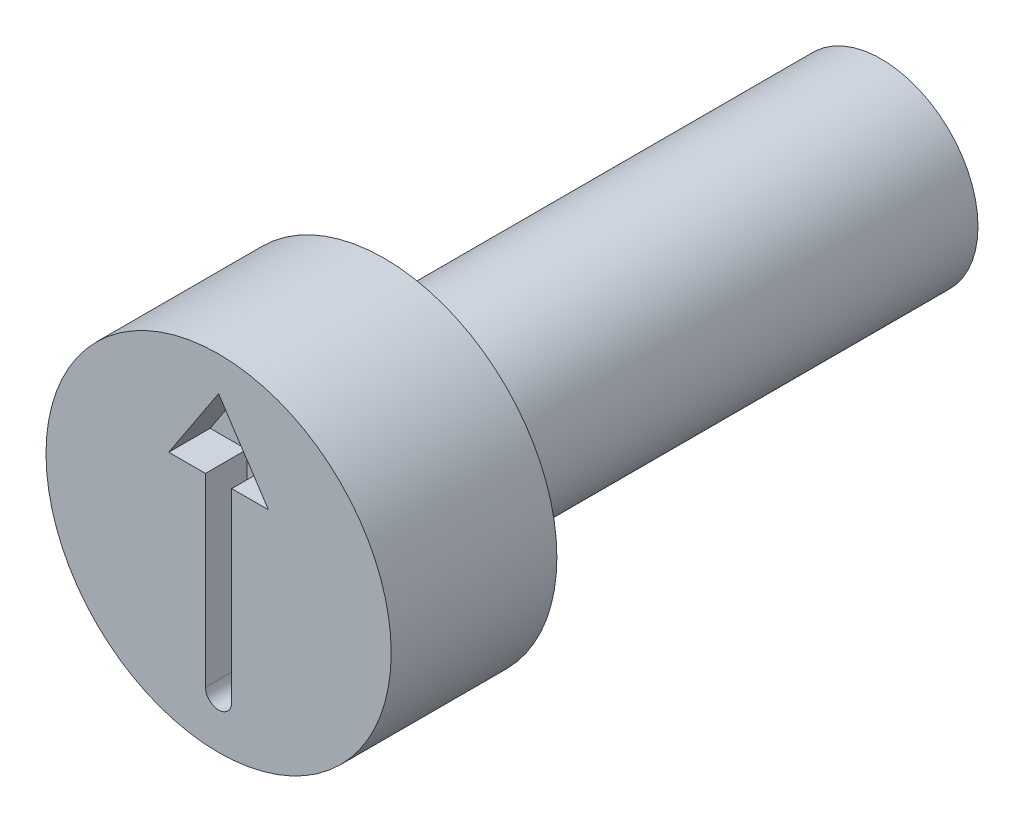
from build123d import *

# Parameters (mm, degrees)
CUT_EXTRUDE4_DEPTH = 0.3


with BuildPart() as part:
    # Sketch2 → Revolve1 (revolve)
    with BuildSketch(Plane(origin=(0, 0, 0), x_dir=(0, 0, -1), z_dir=(1, 0, 0)), mode=Mode.PRIVATE) as revolve1_sk:
        Polygon((0, 1.25), (0, 0), (4.8, 0), (4.8, 0.7), (1.2, 0.7), (1.2, 1.25), align=None)
    revolve(revolve1_sk.sketch.rotate(Axis((0, 0, -0.403888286), (0, 0, -1)), 90), axis=Axis((0, 0, -0.403888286), (0, 0, -1)))

    # Sketch3 → Cut-Extrude4 (cut)
    with BuildSketch(Plane.XY):
        with BuildLine():
            Line((0.095236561, 0.453175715), (0.095236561, -0.888080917))
            ThreePointArc((0.095236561, -0.888080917), (0, -0.983317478), (-0.095236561, -0.888080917))
            Line((-0.095236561, -0.888080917), (-0.095236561, 0.453175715))
            Line((-0.095236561, 0.453175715), (-0.360958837, 0.453175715))
            Line((-0.360958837, 0.453175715), (0, 1.001057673))
            Line((0, 1.001057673), (0.360958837, 0.453175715))
            Line((0.360958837, 0.453175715), (0.095236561, 0.453175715))
        make_face()
    extrude(amount=-CUT_EXTRUDE4_DEPTH, mode=Mode.SUBTRACT)


solid = part.part
